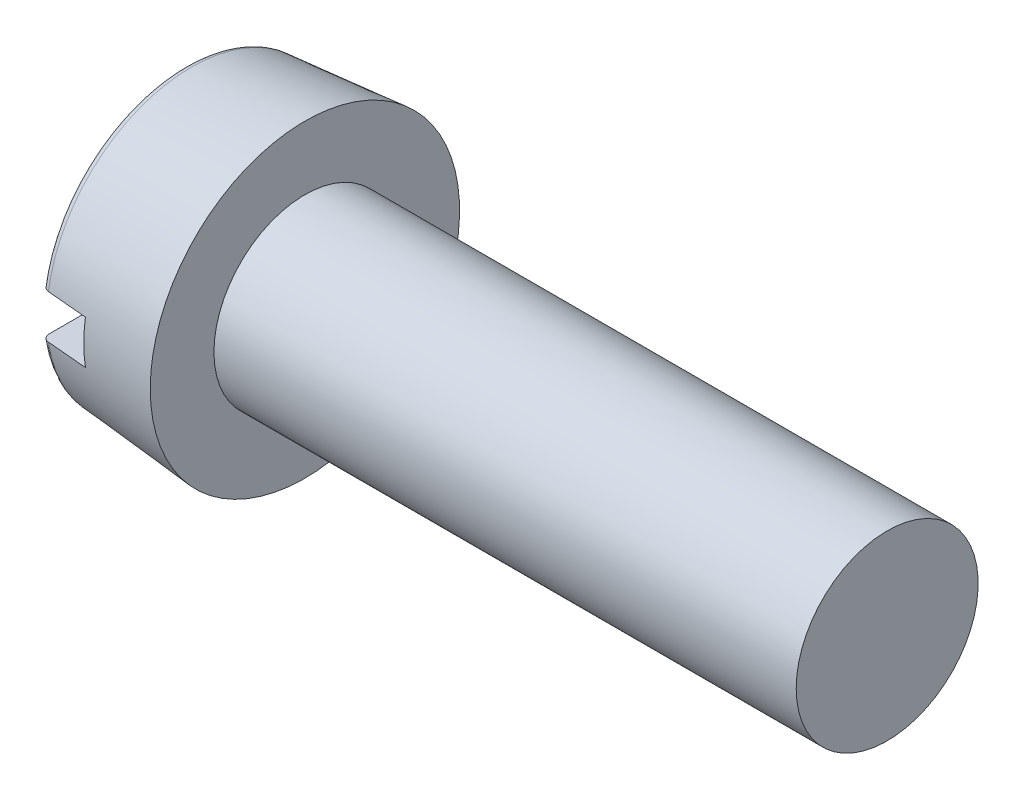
ISO-10303-21;
HEADER;
FILE_DESCRIPTION(('STEP AP214'),'2;1');
FILE_NAME('part.step','',(''),(''),'','','');
FILE_SCHEMA(('AUTOMOTIVE_DESIGN { 1 0 10303 214 1 1 1 1 }'));
ENDSEC;
DATA;
#1=APPLICATION_CONTEXT('core data for automotive mechanical design processes');
#2=APPLICATION_PROTOCOL_DEFINITION('international standard','automotive_design',2000,#1);
#3=PRODUCT_CONTEXT('',#1,'mechanical');
#4=PRODUCT('Part','Part','',(#3));
#5=PRODUCT_RELATED_PRODUCT_CATEGORY('part','',(#4));
#6=PRODUCT_DEFINITION_FORMATION('','',#4);
#7=PRODUCT_DEFINITION_CONTEXT('part definition',#1,'design');
#8=PRODUCT_DEFINITION('design','',#6,#7);
#9=PRODUCT_DEFINITION_SHAPE('','',#8);
#10=(LENGTH_UNIT() NAMED_UNIT(*) SI_UNIT(.MILLI.,.METRE.));
#11=(NAMED_UNIT(*) PLANE_ANGLE_UNIT() SI_UNIT($,.RADIAN.));
#12=(NAMED_UNIT(*) SI_UNIT($,.STERADIAN.) SOLID_ANGLE_UNIT());
#13=UNCERTAINTY_MEASURE_WITH_UNIT(LENGTH_MEASURE(1.E-05),#10,'distance_accuracy_value','');
#14=(GEOMETRIC_REPRESENTATION_CONTEXT(3) GLOBAL_UNCERTAINTY_ASSIGNED_CONTEXT((#13)) GLOBAL_UNIT_ASSIGNED_CONTEXT((#10,
#11,#12)) REPRESENTATION_CONTEXT('',''));
#15=CARTESIAN_POINT('',(0.,0.,0.));
#16=DIRECTION('',(0.,0.,1.));
#17=DIRECTION('',(1.,0.,0.));
#18=AXIS2_PLACEMENT_3D('',#15,#16,#17);
#19=CARTESIAN_POINT('',(0.,0.,0.));
#20=DIRECTION('',(-1.,0.,0.));
#21=DIRECTION('',(0.,0.,1.));
#22=AXIS2_PLACEMENT_3D('',#19,#20,#21);
#23=PLANE('',#22);
#24=DIRECTION('',(0.,0.,-1.));
#25=VECTOR('',#24,1.);
#26=CARTESIAN_POINT('',(0.,0.599999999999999,4.25));
#27=LINE('',#26,#25);
#28=CARTESIAN_POINT('',(0.,0.599999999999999,3.7300729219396));
#29=VERTEX_POINT('',#28);
#30=CARTESIAN_POINT('',(0.,0.599999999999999,-3.7300729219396));
#31=VERTEX_POINT('',#30);
#32=EDGE_CURVE('E105',#29,#31,#27,.T.);
#33=ORIENTED_EDGE('',*,*,#32,.F.);
#34=CARTESIAN_POINT('',(0.,0.,0.));
#35=DIRECTION('',(-1.,0.,0.));
#36=DIRECTION('',(0.,0.,1.));
#37=AXIS2_PLACEMENT_3D('',#34,#35,#36);
#38=CIRCLE('',#37,3.77802117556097);
#39=EDGE_CURVE('E107',#29,#31,#38,.T.);
#40=ORIENTED_EDGE('',*,*,#39,.T.);
#41=EDGE_LOOP('',(#33,#40));
#42=FACE_BOUND('',#41,.T.);
#43=ADVANCED_FACE('F36',(#42),#23,.T.);
#44=CARTESIAN_POINT('',(0.2,0.,0.));
#45=DIRECTION('',(-1.,0.,0.));
#46=DIRECTION('',(0.,0.,1.));
#47=AXIS2_PLACEMENT_3D('',#44,#45,#46);
#48=TOROIDAL_SURFACE('',#47,3.77802117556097,0.2);
#49=CARTESIAN_POINT('',(0.0978816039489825,0.599999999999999,-3.9041500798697));
#50=CARTESIAN_POINT('',(0.107431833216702,0.599999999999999,-3.90988734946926));
#51=CARTESIAN_POINT('',(0.117470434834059,0.599999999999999,-3.91482650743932));
#52=CARTESIAN_POINT('',(0.138241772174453,0.599999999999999,-3.92295497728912));
#53=CARTESIAN_POINT('',(0.148975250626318,0.599999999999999,-3.92614238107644));
#54=CARTESIAN_POINT('',(0.170824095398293,0.599999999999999,-3.93066533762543));
#55=CARTESIAN_POINT('',(0.181939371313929,0.599999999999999,-3.93200132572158));
#56=CARTESIAN_POINT('',(0.204233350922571,0.599999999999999,-3.93278131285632));
#57=CARTESIAN_POINT('',(0.21541203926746,0.599999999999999,-3.93222575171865));
#58=CARTESIAN_POINT('',(0.237483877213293,0.599999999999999,-3.92924514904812));
#59=CARTESIAN_POINT('',(0.248377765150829,0.599999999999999,-3.92682557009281));
#60=CARTESIAN_POINT('',(0.269606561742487,0.599999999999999,-3.92019622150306));
#61=CARTESIAN_POINT('',(0.279941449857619,0.599999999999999,-3.91598638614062));
#62=CARTESIAN_POINT('',(0.299788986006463,0.599999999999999,-3.90588890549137));
#63=CARTESIAN_POINT('',(0.309299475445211,0.599999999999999,-3.89999701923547));
#64=CARTESIAN_POINT('',(0.327207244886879,0.599999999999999,-3.88671307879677));
#65=CARTESIAN_POINT('',(0.335604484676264,0.599999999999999,-3.87932097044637));
#66=CARTESIAN_POINT('',(0.351126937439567,0.599999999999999,-3.86317982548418));
#67=CARTESIAN_POINT('',(0.358240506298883,0.599999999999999,-3.85441959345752));
#68=CARTESIAN_POINT('',(0.370915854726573,0.599999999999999,-3.8358406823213));
#69=CARTESIAN_POINT('',(0.37647754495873,0.599999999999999,-3.82602194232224));
#70=CARTESIAN_POINT('',(0.385959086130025,0.599999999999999,-3.80548344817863));
#71=CARTESIAN_POINT('',(0.389859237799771,0.599999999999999,-3.79475459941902));
#72=CARTESIAN_POINT('',(0.395822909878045,0.599999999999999,-3.77279802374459));
#73=CARTESIAN_POINT('',(0.397886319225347,0.599999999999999,-3.76157026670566));
#74=CARTESIAN_POINT('',(0.400135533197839,0.599999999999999,-3.738815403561));
#75=CARTESIAN_POINT('',(0.400302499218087,0.599999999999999,-3.7272864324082));
#76=CARTESIAN_POINT('',(0.398706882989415,0.599999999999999,-3.70436254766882));
#77=CARTESIAN_POINT('',(0.396944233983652,0.599999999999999,-3.69296763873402));
#78=CARTESIAN_POINT('',(0.391525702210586,0.599999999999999,-3.67058927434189));
#79=CARTESIAN_POINT('',(0.387862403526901,0.599999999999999,-3.65960761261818));
#80=CARTESIAN_POINT('',(0.378736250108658,0.599999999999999,-3.63841894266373));
#81=CARTESIAN_POINT('',(0.373273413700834,0.599999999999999,-3.62821192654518));
#82=CARTESIAN_POINT('',(0.36072407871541,0.599999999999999,-3.60891420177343));
#83=CARTESIAN_POINT('',(0.353644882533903,0.599999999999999,-3.59981874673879));
#84=CARTESIAN_POINT('',(0.338043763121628,0.599999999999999,-3.58296269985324));
#85=CARTESIAN_POINT('',(0.329521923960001,0.599999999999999,-3.57520203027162));
#86=CARTESIAN_POINT('',(0.311380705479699,0.599999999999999,-3.56133319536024));
#87=CARTESIAN_POINT('',(0.301775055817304,0.599999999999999,-3.55520707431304));
#88=CARTESIAN_POINT('',(0.281660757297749,0.599999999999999,-3.54468000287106));
#89=CARTESIAN_POINT('',(0.271152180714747,0.599999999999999,-3.5402789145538));
#90=CARTESIAN_POINT('',(0.249681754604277,0.599999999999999,-3.53338697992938));
#91=CARTESIAN_POINT('',(0.238727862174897,0.599999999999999,-3.53087133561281));
#92=CARTESIAN_POINT('',(0.216552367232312,0.599999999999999,-3.52773269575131));
#93=CARTESIAN_POINT('',(0.205330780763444,0.599999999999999,-3.5271095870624));
#94=CARTESIAN_POINT('',(0.183041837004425,0.599999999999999,-3.52777249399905));
#95=CARTESIAN_POINT('',(0.171973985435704,0.599999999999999,-3.52904203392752));
#96=CARTESIAN_POINT('',(0.150208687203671,0.599999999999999,-3.53342068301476));
#97=CARTESIAN_POINT('',(0.139511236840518,0.599999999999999,-3.53652977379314));
#98=CARTESIAN_POINT('',(0.118782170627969,0.599999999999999,-3.5444943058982));
#99=CARTESIAN_POINT('',(0.10875087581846,0.599999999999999,-3.54935058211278));
#100=CARTESIAN_POINT('',(0.0896358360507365,0.599999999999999,-3.56066349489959));
#101=CARTESIAN_POINT('',(0.0805521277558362,0.599999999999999,-3.56712019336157));
#102=CARTESIAN_POINT('',(0.0634979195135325,0.599999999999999,-3.58151162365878));
#103=CARTESIAN_POINT('',(0.0555384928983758,0.599999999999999,-3.58945947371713));
#104=CARTESIAN_POINT('',(0.0410454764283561,0.599999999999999,-3.60656313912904));
#105=CARTESIAN_POINT('',(0.0345119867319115,0.599999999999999,-3.61571903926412));
#106=CARTESIAN_POINT('',(0.0229642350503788,0.599999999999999,-3.63510981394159));
#107=CARTESIAN_POINT('',(0.0179714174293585,0.599999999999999,-3.64535746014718));
#108=CARTESIAN_POINT('',(0.00975525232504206,0.599999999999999,-3.66653915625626));
#109=CARTESIAN_POINT('',(0.0065320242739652,0.599999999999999,-3.67747325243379));
#110=CARTESIAN_POINT('',(0.00191322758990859,0.599999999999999,-3.69984866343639));
#111=CARTESIAN_POINT('',(0.000538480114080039,0.599999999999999,-3.71129428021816));
#112=CARTESIAN_POINT('',(-0.000278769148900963,0.599999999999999,-3.73425409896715));
#113=CARTESIAN_POINT('',(0.000278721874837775,0.599999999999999,-3.74576830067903));
#114=CARTESIAN_POINT('',(0.00331884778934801,0.599999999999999,-3.76858744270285));
#115=CARTESIAN_POINT('',(0.00580924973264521,0.599999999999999,-3.77989134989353));
#116=CARTESIAN_POINT('',(0.0126611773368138,0.599999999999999,-3.80192080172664));
#117=CARTESIAN_POINT('',(0.0170231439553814,0.599999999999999,-3.8126462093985));
#118=CARTESIAN_POINT('',(0.0274809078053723,0.599999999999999,-3.83316455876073));
#119=CARTESIAN_POINT('',(0.03357021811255,0.599999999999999,-3.84296080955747));
#120=CARTESIAN_POINT('',(0.0473191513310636,0.599999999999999,-3.86136889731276));
#121=CARTESIAN_POINT('',(0.0549767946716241,0.599999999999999,-3.86998220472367));
#122=CARTESIAN_POINT('',(0.0685720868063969,0.599999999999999,-3.8828639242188));
#123=CARTESIAN_POINT('',(0.0741064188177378,0.599999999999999,-3.88756519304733));
#124=CARTESIAN_POINT('',(0.085652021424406,0.599999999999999,-3.89634045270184));
#125=CARTESIAN_POINT('',(0.0916632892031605,0.599999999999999,-3.90041444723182));
#126=CARTESIAN_POINT('',(0.0978816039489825,0.599999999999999,-3.9041500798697));
#127=B_SPLINE_CURVE_WITH_KNOTS('',3,(#49,#50,#51,#52,#53,#54,#55,#56,#57,#58,#59,#60,#61,#62,
#63,#64,#65,#66,#67,#68,#69,#70,#71,#72,#73,#74,#75,#76,#77,#78,#79,#80,#81,#82,#83,#84,#85,#86,
#87,#88,#89,#90,#91,#92,#93,#94,#95,#96,#97,#98,#99,#100,#101,#102,#103,#104,#105,#106,#107,
#108,#109,#110,#111,#112,#113,#114,#115,#116,#117,#118,#119,#120,#121,#122,#123,#124,#125,#126),
.UNSPECIFIED.,.T.,.F.,(4,2,2,2,2,2,2,2,2,2,2,2,2,2,2,2,2,2,2,2,2,2,2,2,2,2,2,2,2,2,2,2,2,2,2,2,
2,2,4),(0.,0.033396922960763,0.0668301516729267,0.100255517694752,0.133673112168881,
0.166993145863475,0.200314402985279,0.233720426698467,0.267127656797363,0.300824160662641,
0.334522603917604,0.368610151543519,0.402699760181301,0.437127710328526,0.471556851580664,
0.506121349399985,0.540685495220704,0.575096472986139,0.609505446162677,0.643519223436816,
0.677530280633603,0.711085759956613,0.744639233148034,0.777902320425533,0.811165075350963,
0.844443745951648,0.877723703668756,0.91131147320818,0.944901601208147,0.978940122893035,
1.01298094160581,1.04740206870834,1.08182306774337,1.11638310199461,1.1509512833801,
1.18539132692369,1.21978816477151,1.24153359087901,1.26327888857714),.UNSPECIFIED.);
#128=CARTESIAN_POINT('',(0.182568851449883,0.599999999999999,-3.93174236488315));
#129=VERTEX_POINT('',#128);
#130=EDGE_CURVE('E60',#31,#129,#127,.T.);
#131=ORIENTED_EDGE('',*,*,#130,.F.);
#132=ORIENTED_EDGE('',*,*,#39,.F.);
#133=CARTESIAN_POINT('',(0.0989587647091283,0.599999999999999,3.55514609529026));
#134=CARTESIAN_POINT('',(0.108521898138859,0.599999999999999,3.5494691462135));
#135=CARTESIAN_POINT('',(0.118567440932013,0.599999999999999,3.54459012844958));
#136=CARTESIAN_POINT('',(0.139342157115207,0.599999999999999,3.53658165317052));
#137=CARTESIAN_POINT('',(0.150072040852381,0.599999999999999,3.53345404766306));
#138=CARTESIAN_POINT('',(0.171904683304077,0.599999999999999,3.52905015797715));
#139=CARTESIAN_POINT('',(0.183007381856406,0.599999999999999,3.5277735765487));
#140=CARTESIAN_POINT('',(0.205266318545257,0.599999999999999,3.52711144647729));
#141=CARTESIAN_POINT('',(0.21642254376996,0.599999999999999,3.52772546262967));
#142=CARTESIAN_POINT('',(0.238429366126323,0.599999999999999,3.53081818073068));
#143=CARTESIAN_POINT('',(0.249280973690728,0.599999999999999,3.53328970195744));
#144=CARTESIAN_POINT('',(0.270417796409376,0.599999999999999,3.54001324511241));
#145=CARTESIAN_POINT('',(0.280702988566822,0.599999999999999,3.54426533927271));
#146=CARTESIAN_POINT('',(0.300457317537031,0.599999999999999,3.55444011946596));
#147=CARTESIAN_POINT('',(0.309923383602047,0.599999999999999,3.5603687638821));
#148=CARTESIAN_POINT('',(0.327740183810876,0.599999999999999,3.57371449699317));
#149=CARTESIAN_POINT('',(0.336090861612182,0.599999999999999,3.58113166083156));
#150=CARTESIAN_POINT('',(0.35154168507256,0.599999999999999,3.59733137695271));
#151=CARTESIAN_POINT('',(0.35862671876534,0.599999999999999,3.60612833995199));
#152=CARTESIAN_POINT('',(0.37124247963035,0.599999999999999,3.6247737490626));
#153=CARTESIAN_POINT('',(0.37677309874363,0.599999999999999,3.63462226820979));
#154=CARTESIAN_POINT('',(0.386199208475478,0.599999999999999,3.65523213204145));
#155=CARTESIAN_POINT('',(0.390071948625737,0.599999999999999,3.66600388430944));
#156=CARTESIAN_POINT('',(0.395972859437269,0.599999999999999,3.68804141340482));
#157=CARTESIAN_POINT('',(0.39800092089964,0.599999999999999,3.69930721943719));
#158=CARTESIAN_POINT('',(0.400168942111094,0.599999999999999,3.72212474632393));
#159=CARTESIAN_POINT('',(0.400291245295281,0.599999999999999,3.73367814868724));
#160=CARTESIAN_POINT('',(0.398597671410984,0.599999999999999,3.7566422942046));
#161=CARTESIAN_POINT('',(0.396781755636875,0.599999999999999,3.76805303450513));
#162=CARTESIAN_POINT('',(0.391254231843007,0.599999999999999,3.790423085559));
#163=CARTESIAN_POINT('',(0.387539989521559,0.599999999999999,3.80138174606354));
#164=CARTESIAN_POINT('',(0.378312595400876,0.599999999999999,3.82251394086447));
#165=CARTESIAN_POINT('',(0.372799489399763,0.599999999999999,3.8326874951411));
#166=CARTESIAN_POINT('',(0.360165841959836,0.599999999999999,3.85188710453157));
#167=CARTESIAN_POINT('',(0.353056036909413,0.599999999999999,3.86092022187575));
#168=CARTESIAN_POINT('',(0.337405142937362,0.599999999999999,3.87764762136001));
#169=CARTESIAN_POINT('',(0.328864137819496,0.599999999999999,3.88534198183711));
#170=CARTESIAN_POINT('',(0.310695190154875,0.599999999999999,3.89908107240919));
#171=CARTESIAN_POINT('',(0.301080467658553,0.599999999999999,3.90514328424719));
#172=CARTESIAN_POINT('',(0.280960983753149,0.599999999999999,3.91554655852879));
#173=CARTESIAN_POINT('',(0.270456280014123,0.599999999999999,3.91988773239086));
#174=CARTESIAN_POINT('',(0.248979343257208,0.599999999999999,3.92667780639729));
#175=CARTESIAN_POINT('',(0.238013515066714,0.599999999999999,3.92914697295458));
#176=CARTESIAN_POINT('',(0.215822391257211,0.599999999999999,3.93219592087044));
#177=CARTESIAN_POINT('',(0.204597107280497,0.599999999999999,3.93277578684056));
#178=CARTESIAN_POINT('',(0.182282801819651,0.599999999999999,3.93203096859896));
#179=CARTESIAN_POINT('',(0.171193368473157,0.599999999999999,3.9307185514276));
#180=CARTESIAN_POINT('',(0.149392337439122,0.599999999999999,3.92625113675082));
#181=CARTESIAN_POINT('',(0.138680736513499,0.599999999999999,3.92309615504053));
#182=CARTESIAN_POINT('',(0.117932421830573,0.599999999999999,3.91503657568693));
#183=CARTESIAN_POINT('',(0.107896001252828,0.599999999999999,3.91013122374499));
#184=CARTESIAN_POINT('',(0.0887813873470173,0.599999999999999,3.89871652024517));
#185=CARTESIAN_POINT('',(0.0797032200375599,0.599999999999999,3.89220712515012));
#186=CARTESIAN_POINT('',(0.0626918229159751,0.599999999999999,3.87772239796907));
#187=CARTESIAN_POINT('',(0.0547671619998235,0.599999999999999,3.8697370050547));
#188=CARTESIAN_POINT('',(0.0403530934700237,0.599999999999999,3.85256196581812));
#189=CARTESIAN_POINT('',(0.0338637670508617,0.599999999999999,3.84337225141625));
#190=CARTESIAN_POINT('',(0.0224273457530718,0.599999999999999,3.82394055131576));
#191=CARTESIAN_POINT('',(0.0174982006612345,0.599999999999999,3.81368800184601));
#192=CARTESIAN_POINT('',(0.0094099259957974,0.599999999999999,3.79250703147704));
#193=CARTESIAN_POINT('',(0.00625090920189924,0.599999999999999,3.78157856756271));
#194=CARTESIAN_POINT('',(0.0017589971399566,0.599999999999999,3.75922808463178));
#195=CARTESIAN_POINT('',(0.00044642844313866,0.599999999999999,3.74780197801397));
#196=CARTESIAN_POINT('',(-0.000254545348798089,0.599999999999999,3.724891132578));
#197=CARTESIAN_POINT('',(0.000357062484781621,0.599999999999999,3.7134063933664));
#198=CARTESIAN_POINT('',(0.00349665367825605,0.599999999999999,3.69063139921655));
#199=CARTESIAN_POINT('',(0.00603609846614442,0.599999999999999,3.67934272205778));
#200=CARTESIAN_POINT('',(0.0129783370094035,0.599999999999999,3.65734990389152));
#201=CARTESIAN_POINT('',(0.0173815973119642,0.599999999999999,3.64664590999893));
#202=CARTESIAN_POINT('',(0.0279247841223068,0.599999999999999,3.62615018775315));
#203=CARTESIAN_POINT('',(0.0340622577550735,0.599999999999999,3.6163571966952));
#204=CARTESIAN_POINT('',(0.0479055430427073,0.599999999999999,3.59796301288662));
#205=CARTESIAN_POINT('',(0.0556093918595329,0.599999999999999,3.58936035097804));
#206=CARTESIAN_POINT('',(0.0693113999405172,0.599999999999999,3.57647168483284));
#207=CARTESIAN_POINT('',(0.0749101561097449,0.599999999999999,3.57175400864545));
#208=CARTESIAN_POINT('',(0.0865893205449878,0.599999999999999,3.56295789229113));
#209=CARTESIAN_POINT('',(0.0926697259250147,0.599999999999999,3.55887944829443));
#210=CARTESIAN_POINT('',(0.0989587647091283,0.599999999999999,3.55514609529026));
#211=B_SPLINE_CURVE_WITH_KNOTS('',3,(#133,#134,#135,#136,#137,#138,#139,#140,#141,#142,#143,
#144,#145,#146,#147,#148,#149,#150,#151,#152,#153,#154,#155,#156,#157,#158,#159,#160,#161,#162,
#163,#164,#165,#166,#167,#168,#169,#170,#171,#172,#173,#174,#175,#176,#177,#178,#179,#180,#181,
#182,#183,#184,#185,#186,#187,#188,#189,#190,#191,#192,#193,#194,#195,#196,#197,#198,#199,#200,
#201,#202,#203,#204,#205,#206,#207,#208,#209,#210),.UNSPECIFIED.,.T.,.F.,(4,2,2,2,2,2,2,2,2,2,2,
2,2,2,2,2,2,2,2,2,2,2,2,2,2,2,2,2,2,2,2,2,2,2,2,2,2,2,4),(0.,0.0333372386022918,
0.0667096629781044,0.100076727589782,0.133436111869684,0.166667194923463,0.199899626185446,
0.233251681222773,0.266605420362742,0.300334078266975,0.334065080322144,0.368245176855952,
0.402427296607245,0.436925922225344,0.471425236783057,0.505972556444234,0.54051899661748,
0.574839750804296,0.609158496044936,0.643093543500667,0.677026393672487,0.710586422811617,
0.744144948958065,0.777486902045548,0.810828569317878,0.844184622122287,0.877541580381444,
0.911134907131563,0.944730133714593,0.978698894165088,1.01266981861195,1.04701186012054,
1.08135413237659,1.11590219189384,1.15045890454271,1.18496698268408,1.21943208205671,
1.24135590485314,1.2632795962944),.UNSPECIFIED.);
#212=CARTESIAN_POINT('',(0.182568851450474,0.599999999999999,3.93174236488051));
#213=VERTEX_POINT('',#212);
#214=EDGE_CURVE('E97',#213,#29,#211,.T.);
#215=ORIENTED_EDGE('',*,*,#214,.F.);
#216=CARTESIAN_POINT('',(0.182568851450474,0.,0.));
#217=DIRECTION('',(-1.,0.,0.));
#218=DIRECTION('',(0.,0.,1.));
#219=AXIS2_PLACEMENT_3D('',#216,#217,#218);
#220=CIRCLE('',#219,3.97726011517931);
#221=EDGE_CURVE('E111',#129,#213,#220,.F.);
#222=ORIENTED_EDGE('',*,*,#221,.F.);
#223=EDGE_LOOP('',(#131,#132,#215,#222));
#224=FACE_BOUND('',#223,.T.);
#225=ADVANCED_FACE('F181',(#224),#48,.T.);
#226=CARTESIAN_POINT('',(-25.4,0.,0.));
#227=DIRECTION('',(-1.,0.,0.));
#228=DIRECTION('',(0.,0.,1.));
#229=AXIS2_PLACEMENT_3D('',#226,#227,#228);
#230=CYLINDRICAL_SURFACE('',#229,2.5);
#231=CARTESIAN_POINT('',(19.3,0.,0.));
#232=DIRECTION('',(-1.,0.,0.));
#233=DIRECTION('',(0.,0.,1.));
#234=AXIS2_PLACEMENT_3D('',#231,#232,#233);
#235=CIRCLE('',#234,2.5);
#236=CARTESIAN_POINT('',(19.3,0.,2.5));
#237=VERTEX_POINT('',#236);
#238=EDGE_CURVE('E169',#237,#237,#235,.T.);
#239=ORIENTED_EDGE('',*,*,#238,.T.);
#240=EDGE_LOOP('',(#239));
#241=FACE_BOUND('',#240,.T.);
#242=CARTESIAN_POINT('',(3.3,0.,0.));
#243=DIRECTION('',(-1.,0.,0.));
#244=DIRECTION('',(0.,0.,1.));
#245=AXIS2_PLACEMENT_3D('',#242,#243,#244);
#246=CIRCLE('',#245,2.5);
#247=CARTESIAN_POINT('',(3.3,0.,2.5));
#248=VERTEX_POINT('',#247);
#249=EDGE_CURVE('E108',#248,#248,#246,.T.);
#250=ORIENTED_EDGE('',*,*,#249,.F.);
#251=EDGE_LOOP('',(#250));
#252=FACE_BOUND('',#251,.T.);
#253=ADVANCED_FACE('F177',(#241,#252),#230,.T.);
#254=CARTESIAN_POINT('',(3.3,2.5,0.));
#255=DIRECTION('',(-1.,0.,0.));
#256=DIRECTION('',(0.,0.,1.));
#257=AXIS2_PLACEMENT_3D('',#254,#255,#256);
#258=PLANE('',#257);
#259=CARTESIAN_POINT('',(3.3,0.,0.));
#260=DIRECTION('',(-1.,0.,0.));
#261=DIRECTION('',(0.,0.,1.));
#262=AXIS2_PLACEMENT_3D('',#259,#260,#261);
#263=CIRCLE('',#262,4.25);
#264=CARTESIAN_POINT('',(3.3,0.,4.25));
#265=VERTEX_POINT('',#264);
#266=EDGE_CURVE('E113',#265,#265,#263,.T.);
#267=ORIENTED_EDGE('',*,*,#266,.F.);
#268=EDGE_LOOP('',(#267));
#269=FACE_BOUND('',#268,.T.);
#270=ORIENTED_EDGE('',*,*,#249,.T.);
#271=EDGE_LOOP('',(#270));
#272=FACE_BOUND('',#271,.T.);
#273=ADVANCED_FACE('F154',(#269,#272),#258,.F.);
#274=CARTESIAN_POINT('',(0.,0.,0.));
#275=DIRECTION('',(1.,0.,0.));
#276=DIRECTION('',(0.,0.,-1.));
#277=AXIS2_PLACEMENT_3D('',#274,#275,#276);
#278=CONICAL_SURFACE('',#277,3.96128741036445,0.0872664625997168);
#279=CARTESIAN_POINT('',(-6.6953629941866,0.599999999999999,-3.32176592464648));
#280=CARTESIAN_POINT('',(-4.63355446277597,0.599999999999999,-3.50505064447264));
#281=CARTESIAN_POINT('',(-2.57170783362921,0.599999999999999,-3.68790585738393));
#282=CARTESIAN_POINT('',(-0.116158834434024,0.599999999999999,-3.9053064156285));
#283=CARTESIAN_POINT('',(0.277517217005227,0.599999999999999,-3.94014895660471));
#284=CARTESIAN_POINT('',(3.12675511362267,0.599999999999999,-4.19224663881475));
#285=CARTESIAN_POINT('',(5.58235185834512,0.599999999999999,-4.40910750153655));
#286=CARTESIAN_POINT('',(8.0379662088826,0.599999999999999,-4.62576818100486));
#287=B_SPLINE_CURVE_WITH_KNOTS('',3,(#279,#280,#281,#282,#283,#284,#285,#286),.UNSPECIFIED.,.F.,
.F.,(4,2,2,4),(0.,6.20981701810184,7.39546178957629,14.790923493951),.UNSPECIFIED.);
#288=CARTESIAN_POINT('',(1.3,0.599999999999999,-4.03060910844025));
#289=VERTEX_POINT('',#288);
#290=EDGE_CURVE('E164',#129,#289,#287,.T.);
#291=ORIENTED_EDGE('',*,*,#290,.F.);
#292=ORIENTED_EDGE('',*,*,#221,.T.);
#293=CARTESIAN_POINT('',(8.0379662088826,0.599999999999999,4.62576818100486));
#294=CARTESIAN_POINT('',(6.81015816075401,0.599999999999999,4.51744744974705));
#295=CARTESIAN_POINT('',(5.58235534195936,0.599999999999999,4.40906739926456));
#296=CARTESIAN_POINT('',(3.12676355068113,0.599999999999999,4.1921509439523));
#297=CARTESIAN_POINT('',(1.89897457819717,0.599999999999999,4.0836145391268));
#298=CARTESIAN_POINT('',(-0.556586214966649,0.599999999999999,3.86634765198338));
#299=CARTESIAN_POINT('',(-1.7843580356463,0.599999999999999,3.75761716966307));
#300=CARTESIAN_POINT('',(-4.23987895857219,0.599999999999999,3.53989961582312));
#301=CARTESIAN_POINT('',(-5.4676280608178,0.599999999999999,3.43091254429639));
#302=CARTESIAN_POINT('',(-6.6953629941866,0.599999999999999,3.32176592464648));
#303=B_SPLINE_CURVE_WITH_KNOTS('',3,(#293,#294,#295,#296,#297,#298,#299,#300,#301,#302),
.UNSPECIFIED.,.F.,.F.,(4,2,2,2,4),(0.,3.69773091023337,7.39546171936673,11.0931925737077,
14.7909235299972),.UNSPECIFIED.);
#304=CARTESIAN_POINT('',(1.3,0.599999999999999,4.03060910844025));
#305=VERTEX_POINT('',#304);
#306=EDGE_CURVE('E160',#305,#213,#303,.T.);
#307=ORIENTED_EDGE('',*,*,#306,.F.);
#308=CARTESIAN_POINT('',(1.3,0.,0.));
#309=DIRECTION('',(-1.,0.,0.));
#310=DIRECTION('',(0.,0.,1.));
#311=AXIS2_PLACEMENT_3D('',#308,#309,#310);
#312=CIRCLE('',#311,4.07502267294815);
#313=CARTESIAN_POINT('',(1.3,-0.6,4.03060910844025));
#314=VERTEX_POINT('',#313);
#315=EDGE_CURVE('E41',#305,#314,#312,.F.);
#316=ORIENTED_EDGE('',*,*,#315,.T.);
#317=CARTESIAN_POINT('',(-6.6953629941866,-0.6,3.32176592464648));
#318=CARTESIAN_POINT('',(-4.63355446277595,-0.6,3.50505064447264));
#319=CARTESIAN_POINT('',(-2.57170783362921,-0.6,3.68790585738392));
#320=CARTESIAN_POINT('',(-0.116158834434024,-0.6,3.9053064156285));
#321=CARTESIAN_POINT('',(0.277517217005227,-0.6,3.94014895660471));
#322=CARTESIAN_POINT('',(3.12675511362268,-0.6,4.19224663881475));
#323=CARTESIAN_POINT('',(5.58235185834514,-0.6,4.40910750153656));
#324=CARTESIAN_POINT('',(8.0379662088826,-0.6,4.62576818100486));
#325=B_SPLINE_CURVE_WITH_KNOTS('',3,(#317,#318,#319,#320,#321,#322,#323,#324),.UNSPECIFIED.,.F.,
.F.,(4,2,2,4),(0.,6.20981701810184,7.39546178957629,14.790923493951),.UNSPECIFIED.);
#326=CARTESIAN_POINT('',(0.182568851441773,-0.6,3.93174236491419));
#327=VERTEX_POINT('',#326);
#328=EDGE_CURVE('E138',#327,#314,#325,.T.);
#329=ORIENTED_EDGE('',*,*,#328,.F.);
#330=CARTESIAN_POINT('',(0.182568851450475,-0.599999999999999,-3.93174236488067));
#331=VERTEX_POINT('',#330);
#332=EDGE_CURVE('E117',#327,#331,#220,.F.);
#333=ORIENTED_EDGE('',*,*,#332,.T.);
#334=CARTESIAN_POINT('',(8.0379662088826,-0.599999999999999,-4.62576818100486));
#335=CARTESIAN_POINT('',(6.81015816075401,-0.599999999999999,-4.51744744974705));
#336=CARTESIAN_POINT('',(5.58235534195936,-0.599999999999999,-4.40906739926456));
#337=CARTESIAN_POINT('',(3.12676355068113,-0.599999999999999,-4.1921509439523));
#338=CARTESIAN_POINT('',(1.89897457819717,-0.599999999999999,-4.0836145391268));
#339=CARTESIAN_POINT('',(-0.556586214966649,-0.599999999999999,-3.86634765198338));
#340=CARTESIAN_POINT('',(-1.7843580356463,-0.6,-3.75761716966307));
#341=CARTESIAN_POINT('',(-4.23987895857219,-0.6,-3.53989961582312));
#342=CARTESIAN_POINT('',(-5.4676280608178,-0.6,-3.43091254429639));
#343=CARTESIAN_POINT('',(-6.6953629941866,-0.6,-3.32176592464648));
#344=B_SPLINE_CURVE_WITH_KNOTS('',3,(#334,#335,#336,#337,#338,#339,#340,#341,#342,#343),
.UNSPECIFIED.,.F.,.F.,(4,2,2,2,4),(0.,3.69773091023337,7.39546171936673,11.0931925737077,
14.7909235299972),.UNSPECIFIED.);
#345=CARTESIAN_POINT('',(1.3,-0.599999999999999,-4.03060910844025));
#346=VERTEX_POINT('',#345);
#347=EDGE_CURVE('E92',#346,#331,#344,.T.);
#348=ORIENTED_EDGE('',*,*,#347,.F.);
#349=EDGE_CURVE('E11',#346,#289,#312,.F.);
#350=ORIENTED_EDGE('',*,*,#349,.T.);
#351=EDGE_LOOP('',(#291,#292,#307,#316,#329,#333,#348,#350));
#352=FACE_BOUND('',#351,.T.);
#353=ORIENTED_EDGE('',*,*,#266,.T.);
#354=EDGE_LOOP('',(#353));
#355=FACE_BOUND('',#354,.T.);
#356=ADVANCED_FACE('F149',(#352,#355),#278,.T.);
#357=DIRECTION('',(0.,0.,1.));
#358=VECTOR('',#357,1.);
#359=CARTESIAN_POINT('',(0.,-0.599999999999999,-4.25));
#360=LINE('',#359,#358);
#361=CARTESIAN_POINT('',(0.,-0.599999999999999,-3.7300729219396));
#362=VERTEX_POINT('',#361);
#363=CARTESIAN_POINT('',(0.,-0.6,3.7300729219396));
#364=VERTEX_POINT('',#363);
#365=EDGE_CURVE('E52',#362,#364,#360,.T.);
#366=ORIENTED_EDGE('',*,*,#365,.F.);
#367=EDGE_CURVE('E103',#362,#364,#38,.T.);
#368=ORIENTED_EDGE('',*,*,#367,.T.);
#369=EDGE_LOOP('',(#366,#368));
#370=FACE_BOUND('',#369,.T.);
#371=ADVANCED_FACE('F102',(#370),#23,.T.);
#372=CARTESIAN_POINT('',(19.3,2.5,0.));
#373=DIRECTION('',(1.,0.,0.));
#374=DIRECTION('',(0.,0.,-1.));
#375=AXIS2_PLACEMENT_3D('',#372,#373,#374);
#376=PLANE('',#375);
#377=ORIENTED_EDGE('',*,*,#238,.F.);
#378=EDGE_LOOP('',(#377));
#379=FACE_BOUND('',#378,.T.);
#380=ADVANCED_FACE('F193',(#379),#376,.T.);
#381=CARTESIAN_POINT('',(0.0978816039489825,-0.599999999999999,-3.9041500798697));
#382=CARTESIAN_POINT('',(0.0881950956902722,-0.599999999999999,-3.89832974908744));
#383=CARTESIAN_POINT('',(0.0789969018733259,-0.599999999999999,-3.89167965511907));
#384=CARTESIAN_POINT('',(0.061844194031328,-0.599999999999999,-3.87691933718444));
#385=CARTESIAN_POINT('',(0.0538913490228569,-0.599999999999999,-3.86880718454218));
#386=CARTESIAN_POINT('',(0.0394634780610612,-0.599999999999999,-3.85137351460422));
#387=CARTESIAN_POINT('',(0.0329870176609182,-0.599999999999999,-3.8420531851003));
#388=CARTESIAN_POINT('',(0.0216772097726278,-0.599999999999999,-3.82246802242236));
#389=CARTESIAN_POINT('',(0.0168434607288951,-0.599999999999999,-3.81220342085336));
#390=CARTESIAN_POINT('',(0.00890740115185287,-0.599999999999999,-3.79092409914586));
#391=CARTESIAN_POINT('',(0.00582042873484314,-0.6,-3.77990365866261));
#392=CARTESIAN_POINT('',(0.00152206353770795,-0.6,-3.75750231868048));
#393=CARTESIAN_POINT('',(0.000310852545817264,-0.6,-3.74612138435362));
#394=CARTESIAN_POINT('',(-0.000207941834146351,-0.6,-3.72321442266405));
#395=CARTESIAN_POINT('',(0.000501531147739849,-0.6,-3.71168800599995));
#396=CARTESIAN_POINT('',(0.00384085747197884,-0.6,-3.68891650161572));
#397=CARTESIAN_POINT('',(0.00647075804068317,-0.6,-3.67767142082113));
#398=CARTESIAN_POINT('',(0.0135886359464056,-0.6,-3.6557584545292));
#399=CARTESIAN_POINT('',(0.018080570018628,-0.6,-3.64509185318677));
#400=CARTESIAN_POINT('',(0.0288023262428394,-0.6,-3.62467067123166));
#401=CARTESIAN_POINT('',(0.0350321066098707,-0.6,-3.61491606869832));
#402=CARTESIAN_POINT('',(0.049015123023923,-0.6,-3.59666497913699));
#403=CARTESIAN_POINT('',(0.0567585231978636,-0.6,-3.58816095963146));
#404=CARTESIAN_POINT('',(0.0735792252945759,-0.6,-3.57259378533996));
#405=CARTESIAN_POINT('',(0.082656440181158,-0.6,-3.5655305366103));
#406=CARTESIAN_POINT('',(0.101766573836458,-0.6,-3.5531407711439));
#407=CARTESIAN_POINT('',(0.111786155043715,-0.6,-3.54779368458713));
#408=CARTESIAN_POINT('',(0.132589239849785,-0.6,-3.53888288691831));
#409=CARTESIAN_POINT('',(0.143372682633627,-0.6,-3.53531903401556));
#410=CARTESIAN_POINT('',(0.165247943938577,-0.6,-3.53012087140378));
#411=CARTESIAN_POINT('',(0.176333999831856,-0.6,-3.52846229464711));
#412=CARTESIAN_POINT('',(0.198626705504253,-0.6,-3.52704408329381));
#413=CARTESIAN_POINT('',(0.209833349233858,-0.6,-3.52728435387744));
#414=CARTESIAN_POINT('',(0.231968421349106,-0.6,-3.52964795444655));
#415=CARTESIAN_POINT('',(0.242898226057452,-0.6,-3.53175842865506));
#416=CARTESIAN_POINT('',(0.264249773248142,-0.6,-3.53777970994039));
#417=CARTESIAN_POINT('',(0.274671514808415,-0.6,-3.54169052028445));
#418=CARTESIAN_POINT('',(0.294743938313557,-0.6,-3.55120678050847));
#419=CARTESIAN_POINT('',(0.304392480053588,-0.6,-3.55681674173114));
#420=CARTESIAN_POINT('',(0.322623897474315,-0.6,-3.56956065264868));
#421=CARTESIAN_POINT('',(0.331206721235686,-0.6,-3.57669467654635));
#422=CARTESIAN_POINT('',(0.347162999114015,-0.6,-3.59236378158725));
#423=CARTESIAN_POINT('',(0.354522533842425,-0.6,-3.60091303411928));
#424=CARTESIAN_POINT('',(0.367724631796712,-0.6,-3.61911181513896));
#425=CARTESIAN_POINT('',(0.373567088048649,-0.6,-3.62876142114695));
#426=CARTESIAN_POINT('',(0.38365072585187,-0.6,-3.64902581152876));
#427=CARTESIAN_POINT('',(0.387869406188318,-0.6,-3.65965179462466));
#428=CARTESIAN_POINT('',(0.394482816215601,-0.6,-3.68145703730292));
#429=CARTESIAN_POINT('',(0.396877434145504,-0.6,-3.69263633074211));
#430=CARTESIAN_POINT('',(0.399794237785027,-0.6,-3.71534929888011));
#431=CARTESIAN_POINT('',(0.400297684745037,-0.6,-3.72688538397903));
#432=CARTESIAN_POINT('',(0.39936563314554,-0.6,-3.7498792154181));
#433=CARTESIAN_POINT('',(0.39793008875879,-0.6,-3.76133695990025));
#434=CARTESIAN_POINT('',(0.393150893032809,-0.6,-3.7838745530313));
#435=CARTESIAN_POINT('',(0.389802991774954,-0.599999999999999,-3.79495350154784));
#436=CARTESIAN_POINT('',(0.381283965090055,-0.599999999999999,-3.81638712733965));
#437=CARTESIAN_POINT('',(0.376112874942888,-0.599999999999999,-3.82674181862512));
#438=CARTESIAN_POINT('',(0.364122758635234,-0.599999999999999,-3.84636555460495));
#439=CARTESIAN_POINT('',(0.357313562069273,-0.599999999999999,-3.85564060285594));
#440=CARTESIAN_POINT('',(0.342218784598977,-0.599999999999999,-3.87289984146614));
#441=CARTESIAN_POINT('',(0.333933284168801,-0.599999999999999,-3.88088410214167));
#442=CARTESIAN_POINT('',(0.316217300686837,-0.599999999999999,-3.89524122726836));
#443=CARTESIAN_POINT('',(0.30680029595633,-0.599999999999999,-3.90163072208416));
#444=CARTESIAN_POINT('',(0.287017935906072,-0.599999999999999,-3.91271670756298));
#445=CARTESIAN_POINT('',(0.276652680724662,-0.599999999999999,-3.91741337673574));
#446=CARTESIAN_POINT('',(0.255394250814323,-0.599999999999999,-3.92492682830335));
#447=CARTESIAN_POINT('',(0.244508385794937,-0.599999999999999,-3.92776430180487));
#448=CARTESIAN_POINT('',(0.222410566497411,-0.599999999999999,-3.93155747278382));
#449=CARTESIAN_POINT('',(0.21119854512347,-0.599999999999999,-3.93251278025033));
#450=CARTESIAN_POINT('',(0.188849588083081,-0.599999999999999,-3.9325116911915));
#451=CARTESIAN_POINT('',(0.177712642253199,-0.599999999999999,-3.93156779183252));
#452=CARTESIAN_POINT('',(0.155765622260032,-0.599999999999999,-3.92782195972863));
#453=CARTESIAN_POINT('',(0.144955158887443,-0.599999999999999,-3.92502233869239));
#454=CARTESIAN_POINT('',(0.128093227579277,-0.599999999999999,-3.91910685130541));
#455=CARTESIAN_POINT('',(0.121840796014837,-0.599999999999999,-3.91654743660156));
#456=CARTESIAN_POINT('',(0.109628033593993,-0.599999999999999,-3.91080739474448));
#457=CARTESIAN_POINT('',(0.103667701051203,-0.599999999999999,-3.90762677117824));
#458=CARTESIAN_POINT('',(0.0978816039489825,-0.599999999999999,-3.9041500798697));
#459=B_SPLINE_CURVE_WITH_KNOTS('',3,(#381,#382,#383,#384,#385,#386,#387,#388,#389,#390,#391,
#392,#393,#394,#395,#396,#397,#398,#399,#400,#401,#402,#403,#404,#405,#406,#407,#408,#409,#410,
#411,#412,#413,#414,#415,#416,#417,#418,#419,#420,#421,#422,#423,#424,#425,#426,#427,#428,#429,
#430,#431,#432,#433,#434,#435,#436,#437,#438,#439,#440,#441,#442,#443,#444,#445,#446,#447,#448,
#449,#450,#451,#452,#453,#454,#455,#456,#457,#458),.UNSPECIFIED.,.T.,.F.,(4,2,2,2,2,2,2,2,2,2,2,
2,2,2,2,2,2,2,2,2,2,2,2,2,2,2,2,2,2,2,2,2,2,2,2,2,2,2,4),(0.,0.0338769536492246,
0.0677989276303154,0.101687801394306,0.135568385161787,0.169742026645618,0.203918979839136,
0.238400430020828,0.27288272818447,0.307438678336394,0.341993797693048,0.376331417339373,
0.410666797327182,0.444573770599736,0.478478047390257,0.511945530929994,0.545411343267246,
0.578648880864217,0.611886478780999,0.645213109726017,0.678541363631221,0.712226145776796,
0.745913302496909,0.78005177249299,0.814192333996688,0.848670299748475,0.883149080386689,
0.917704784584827,0.952259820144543,0.986612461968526,1.02096323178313,1.05493922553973,
1.08891163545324,1.12249923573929,1.15609379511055,1.18946801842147,1.22280074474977,
1.24303677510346,1.26327268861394),.UNSPECIFIED.);
#460=EDGE_CURVE('E88',#331,#362,#459,.T.);
#461=ORIENTED_EDGE('',*,*,#460,.F.);
#462=ORIENTED_EDGE('',*,*,#332,.F.);
#463=CARTESIAN_POINT('',(0.0989587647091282,-0.6,3.55514609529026));
#464=CARTESIAN_POINT('',(0.0892266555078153,-0.6,3.56092454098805));
#465=CARTESIAN_POINT('',(0.0799799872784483,-0.6,3.56753804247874));
#466=CARTESIAN_POINT('',(0.06272516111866,-0.6,3.58223435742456));
#467=CARTESIAN_POINT('',(0.0547187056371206,-0.6,3.59031915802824));
#468=CARTESIAN_POINT('',(0.0401794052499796,-0.6,3.60770612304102));
#469=CARTESIAN_POINT('',(0.0336450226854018,-0.6,3.61700700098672));
#470=CARTESIAN_POINT('',(0.0222150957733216,-0.6,3.63656222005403));
#471=CARTESIAN_POINT('',(0.0173191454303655,-0.6,3.64681632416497));
#472=CARTESIAN_POINT('',(0.00925180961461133,-0.6,3.66809504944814));
#473=CARTESIAN_POINT('',(0.00609747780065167,-0.6,3.67912613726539));
#474=CARTESIAN_POINT('',(0.00166905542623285,-0.6,3.70156013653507));
#475=CARTESIAN_POINT('',(0.000395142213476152,-0.6,3.71296308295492));
#476=CARTESIAN_POINT('',(-0.000240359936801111,-0.6,3.7359125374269));
#477=CARTESIAN_POINT('',(0.000413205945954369,-0.6,3.74745946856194));
#478=CARTESIAN_POINT('',(0.0036499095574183,-0.6,3.77027994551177));
#479=CARTESIAN_POINT('',(0.00623306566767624,-0.6,3.78155348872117));
#480=CARTESIAN_POINT('',(0.0132607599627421,-0.6,3.8035013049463));
#481=CARTESIAN_POINT('',(0.0177047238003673,-0.6,3.81417576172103));
#482=CARTESIAN_POINT('',(0.0283353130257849,-0.6,3.83461881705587));
#483=CARTESIAN_POINT('',(0.0345218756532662,-0.6,3.84438744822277));
#484=CARTESIAN_POINT('',(0.0484132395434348,-0.6,3.86265777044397));
#485=CARTESIAN_POINT('',(0.0561058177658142,-0.6,3.87116875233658));
#486=CARTESIAN_POINT('',(0.0728255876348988,-0.6,3.88675982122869));
#487=CARTESIAN_POINT('',(0.0818526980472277,-0.6,3.89383999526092));
#488=CARTESIAN_POINT('',(0.100873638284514,-0.6,3.90628136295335));
#489=CARTESIAN_POINT('',(0.110855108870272,-0.6,3.91166145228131));
#490=CARTESIAN_POINT('',(0.131586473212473,-0.6,3.92064922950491));
#491=CARTESIAN_POINT('',(0.142336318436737,-0.6,3.92425702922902));
#492=CARTESIAN_POINT('',(0.164179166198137,-0.6,3.92956149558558));
#493=CARTESIAN_POINT('',(0.175267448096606,-0.6,3.93127761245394));
#494=CARTESIAN_POINT('',(0.197574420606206,-0.6,3.93281315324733));
#495=CARTESIAN_POINT('',(0.208793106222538,-0.6,3.93263264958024));
#496=CARTESIAN_POINT('',(0.23098096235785,-0.6,3.93038649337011));
#497=CARTESIAN_POINT('',(0.241951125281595,-0.6,3.92833062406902));
#498=CARTESIAN_POINT('',(0.263391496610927,-0.6,3.92240956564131));
#499=CARTESIAN_POINT('',(0.273861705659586,-0.6,3.91854437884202));
#500=CARTESIAN_POINT('',(0.294028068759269,-0.6,3.90911121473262));
#501=CARTESIAN_POINT('',(0.30372274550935,-0.6,3.90354008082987));
#502=CARTESIAN_POINT('',(0.322049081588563,-0.6,3.89086175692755));
#503=CARTESIAN_POINT('',(0.330680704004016,-0.6,3.88375451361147));
#504=CARTESIAN_POINT('',(0.346713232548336,-0.6,3.86814574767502));
#505=CARTESIAN_POINT('',(0.354103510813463,-0.6,3.85963331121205));
#506=CARTESIAN_POINT('',(0.367369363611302,-0.6,3.84150054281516));
#507=CARTESIAN_POINT('',(0.373244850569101,-0.6,3.83188014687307));
#508=CARTESIAN_POINT('',(0.383385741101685,-0.6,3.81168683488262));
#509=CARTESIAN_POINT('',(0.387631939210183,-0.6,3.80110427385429));
#510=CARTESIAN_POINT('',(0.394307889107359,-0.6,3.7793809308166));
#511=CARTESIAN_POINT('',(0.396737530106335,-0.6,3.76824011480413));
#512=CARTESIAN_POINT('',(0.399734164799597,-0.6,3.74559372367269));
#513=CARTESIAN_POINT('',(0.400281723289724,-0.6,3.73408557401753));
#514=CARTESIAN_POINT('',(0.399446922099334,-0.6,3.71113926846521));
#515=CARTESIAN_POINT('',(0.3980644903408,-0.6,3.69970111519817));
#516=CARTESIAN_POINT('',(0.393395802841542,-0.6,3.67716390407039));
#517=CARTESIAN_POINT('',(0.390100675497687,-0.6,3.66606668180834));
#518=CARTESIAN_POINT('',(0.381687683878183,-0.6,3.64458566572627));
#519=CARTESIAN_POINT('',(0.376569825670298,-0.6,3.63420186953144));
#520=CARTESIAN_POINT('',(0.364671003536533,-0.6,3.61448591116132));
#521=CARTESIAN_POINT('',(0.35789608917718,-0.6,3.6051500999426));
#522=CARTESIAN_POINT('',(0.342859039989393,-0.6,3.58776429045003));
#523=CARTESIAN_POINT('',(0.334596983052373,-0.6,3.57971422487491));
#524=CARTESIAN_POINT('',(0.316915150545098,-0.6,3.56522505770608));
#525=CARTESIAN_POINT('',(0.307509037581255,-0.6,3.55876928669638));
#526=CARTESIAN_POINT('',(0.287735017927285,-0.6,3.54755418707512));
#527=CARTESIAN_POINT('',(0.277367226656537,-0.6,3.54279465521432));
#528=CARTESIAN_POINT('',(0.256115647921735,-0.6,3.53517350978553));
#529=CARTESIAN_POINT('',(0.245240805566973,-0.6,3.53228694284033));
#530=CARTESIAN_POINT('',(0.223156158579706,-0.6,3.52839929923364));
#531=CARTESIAN_POINT('',(0.21194628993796,-0.6,3.52739858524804));
#532=CARTESIAN_POINT('',(0.189620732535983,-0.6,3.52731515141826));
#533=CARTESIAN_POINT('',(0.178505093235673,-0.6,3.52821544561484));
#534=CARTESIAN_POINT('',(0.15659324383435,-0.6,3.53187166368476));
#535=CARTESIAN_POINT('',(0.145796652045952,-0.6,3.53462526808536));
#536=CARTESIAN_POINT('',(0.128988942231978,-0.6,3.54045125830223));
#537=CARTESIAN_POINT('',(0.122778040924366,-0.6,3.54296414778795));
#538=CARTESIAN_POINT('',(0.110641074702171,-0.6,3.54860268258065));
#539=CARTESIAN_POINT('',(0.104715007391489,-0.6,3.55172832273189));
#540=CARTESIAN_POINT('',(0.0989587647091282,-0.6,3.55514609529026));
#541=B_SPLINE_CURVE_WITH_KNOTS('',3,(#463,#464,#465,#466,#467,#468,#469,#470,#471,#472,#473,
#474,#475,#476,#477,#478,#479,#480,#481,#482,#483,#484,#485,#486,#487,#488,#489,#490,#491,#492,
#493,#494,#495,#496,#497,#498,#499,#500,#501,#502,#503,#504,#505,#506,#507,#508,#509,#510,#511,
#512,#513,#514,#515,#516,#517,#518,#519,#520,#521,#522,#523,#524,#525,#526,#527,#528,#529,#530,
#531,#532,#533,#534,#535,#536,#537,#538,#539,#540),.UNSPECIFIED.,.T.,.F.,(4,2,2,2,2,2,2,2,2,2,2,
2,2,2,2,2,2,2,2,2,2,2,2,2,2,2,2,2,2,2,2,2,2,2,2,2,2,2,4),(0.,0.0339301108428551,
0.0679063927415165,0.101847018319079,0.135779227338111,0.170038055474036,0.204300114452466,
0.238832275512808,0.273364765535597,0.307886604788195,0.342407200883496,0.376658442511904,
0.410907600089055,0.444761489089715,0.478613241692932,0.512113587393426,0.545612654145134,
0.578937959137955,0.612263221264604,0.645650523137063,0.679038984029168,0.712700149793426,
0.746363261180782,0.780411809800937,0.814462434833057,0.848863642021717,0.883266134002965,
0.917829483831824,0.952392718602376,0.986831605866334,1.02126868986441,1.05532881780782,
1.08938486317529,1.12297732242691,1.15657624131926,1.1898762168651,1.22313459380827,
1.24320337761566,1.2632719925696),.UNSPECIFIED.);
#542=EDGE_CURVE('E98',#364,#327,#541,.T.);
#543=ORIENTED_EDGE('',*,*,#542,.F.);
#544=ORIENTED_EDGE('',*,*,#367,.F.);
#545=EDGE_LOOP('',(#461,#462,#543,#544));
#546=FACE_BOUND('',#545,.T.);
#547=ADVANCED_FACE('F38',(#546),#48,.T.);
#548=CARTESIAN_POINT('',(1.3,0.599999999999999,4.25));
#549=DIRECTION('',(0.,1.,0.));
#550=DIRECTION('',(0.,0.,1.));
#551=AXIS2_PLACEMENT_3D('',#548,#549,#550);
#552=PLANE('',#551);
#553=ORIENTED_EDGE('',*,*,#290,.T.);
#554=DIRECTION('',(0.,0.,-1.));
#555=VECTOR('',#554,1.);
#556=CARTESIAN_POINT('',(1.3,0.599999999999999,4.25));
#557=LINE('',#556,#555);
#558=EDGE_CURVE('E104',#305,#289,#557,.T.);
#559=ORIENTED_EDGE('',*,*,#558,.F.);
#560=ORIENTED_EDGE('',*,*,#306,.T.);
#561=ORIENTED_EDGE('',*,*,#214,.T.);
#562=ORIENTED_EDGE('',*,*,#32,.T.);
#563=ORIENTED_EDGE('',*,*,#130,.T.);
#564=EDGE_LOOP('',(#553,#559,#560,#561,#562,#563));
#565=FACE_BOUND('',#564,.T.);
#566=ADVANCED_FACE('F130',(#565),#552,.F.);
#567=CARTESIAN_POINT('',(1.3,-0.599999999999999,-4.25));
#568=DIRECTION('',(0.,-1.,0.));
#569=DIRECTION('',(0.,0.,-1.));
#570=AXIS2_PLACEMENT_3D('',#567,#568,#569);
#571=PLANE('',#570);
#572=ORIENTED_EDGE('',*,*,#347,.T.);
#573=ORIENTED_EDGE('',*,*,#460,.T.);
#574=ORIENTED_EDGE('',*,*,#365,.T.);
#575=ORIENTED_EDGE('',*,*,#542,.T.);
#576=ORIENTED_EDGE('',*,*,#328,.T.);
#577=DIRECTION('',(0.,0.,1.));
#578=VECTOR('',#577,1.);
#579=CARTESIAN_POINT('',(1.3,-0.599999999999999,-4.25));
#580=LINE('',#579,#578);
#581=EDGE_CURVE('E143',#346,#314,#580,.T.);
#582=ORIENTED_EDGE('',*,*,#581,.F.);
#583=EDGE_LOOP('',(#572,#573,#574,#575,#576,#582));
#584=FACE_BOUND('',#583,.T.);
#585=ADVANCED_FACE('F89',(#584),#571,.F.);
#586=CARTESIAN_POINT('',(1.3,0.599999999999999,-4.25));
#587=DIRECTION('',(-1.,0.,0.));
#588=DIRECTION('',(0.,0.,1.));
#589=AXIS2_PLACEMENT_3D('',#586,#587,#588);
#590=PLANE('',#589);
#591=ORIENTED_EDGE('',*,*,#581,.T.);
#592=ORIENTED_EDGE('',*,*,#315,.F.);
#593=ORIENTED_EDGE('',*,*,#558,.T.);
#594=ORIENTED_EDGE('',*,*,#349,.F.);
#595=EDGE_LOOP('',(#591,#592,#593,#594));
#596=FACE_BOUND('',#595,.T.);
#597=ADVANCED_FACE('F129',(#596),#590,.T.);
#598=CLOSED_SHELL('',(#43,#225,#253,#273,#356,#371,#380,#547,#566,#585,#597));
#599=MANIFOLD_SOLID_BREP('B2',#598);
#600=ADVANCED_BREP_SHAPE_REPRESENTATION('',(#18,#599),#14);
#601=SHAPE_DEFINITION_REPRESENTATION(#9,#600);
ENDSEC;
END-ISO-10303-21;
